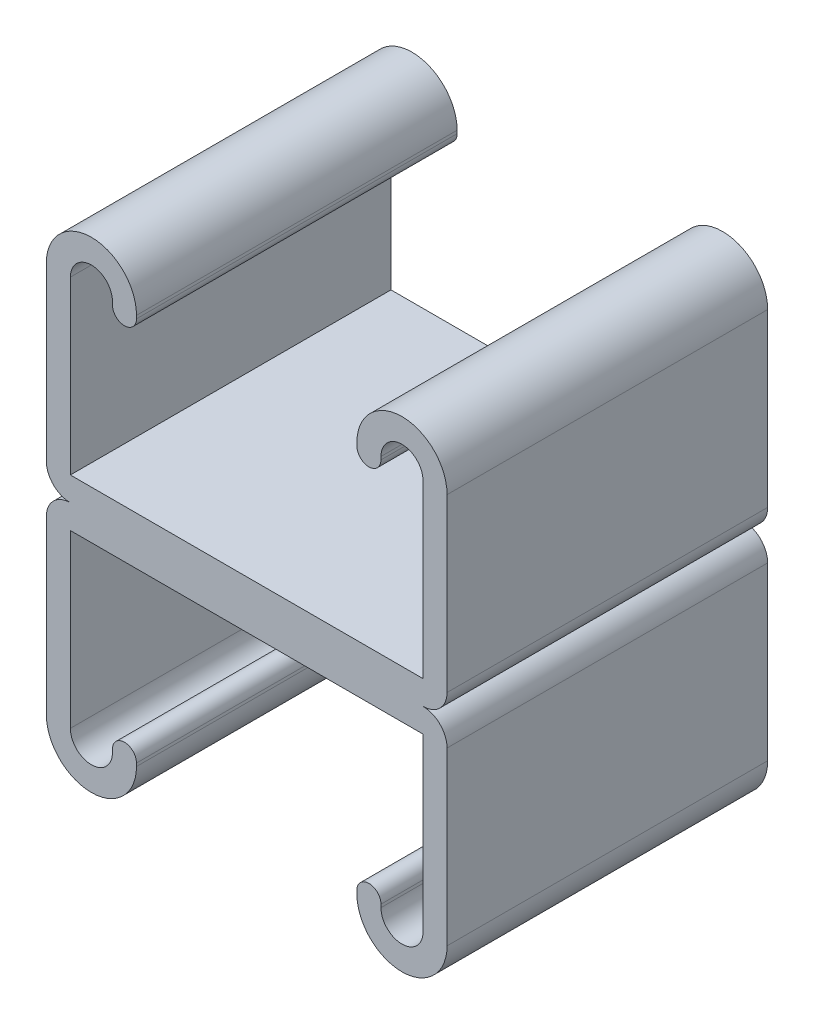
ISO-10303-21;
HEADER;
FILE_DESCRIPTION(('STEP AP214'),'2;1');
FILE_NAME('part.step','',(''),(''),'','','');
FILE_SCHEMA(('AUTOMOTIVE_DESIGN { 1 0 10303 214 1 1 1 1 }'));
ENDSEC;
DATA;
#1=APPLICATION_CONTEXT('core data for automotive mechanical design processes');
#2=APPLICATION_PROTOCOL_DEFINITION('international standard','automotive_design',2000,#1);
#3=PRODUCT_CONTEXT('',#1,'mechanical');
#4=PRODUCT('Part','Part','',(#3));
#5=PRODUCT_RELATED_PRODUCT_CATEGORY('part','',(#4));
#6=PRODUCT_DEFINITION_FORMATION('','',#4);
#7=PRODUCT_DEFINITION_CONTEXT('part definition',#1,'design');
#8=PRODUCT_DEFINITION('design','',#6,#7);
#9=PRODUCT_DEFINITION_SHAPE('','',#8);
#10=(LENGTH_UNIT() NAMED_UNIT(*) SI_UNIT(.MILLI.,.METRE.));
#11=(NAMED_UNIT(*) PLANE_ANGLE_UNIT() SI_UNIT($,.RADIAN.));
#12=(NAMED_UNIT(*) SI_UNIT($,.STERADIAN.) SOLID_ANGLE_UNIT());
#13=UNCERTAINTY_MEASURE_WITH_UNIT(LENGTH_MEASURE(1.E-05),#10,'distance_accuracy_value','');
#14=(GEOMETRIC_REPRESENTATION_CONTEXT(3) GLOBAL_UNCERTAINTY_ASSIGNED_CONTEXT((#13)) GLOBAL_UNIT_ASSIGNED_CONTEXT((#10,
#11,#12)) REPRESENTATION_CONTEXT('',''));
#15=CARTESIAN_POINT('',(0.,0.,0.));
#16=DIRECTION('',(0.,0.,1.));
#17=DIRECTION('',(1.,0.,0.));
#18=AXIS2_PLACEMENT_3D('',#15,#16,#17);
#19=CARTESIAN_POINT('',(-12.303125,15.478125,12.7));
#20=DIRECTION('',(0.,0.,-1.));
#21=DIRECTION('',(-1.,0.,0.));
#22=AXIS2_PLACEMENT_3D('',#19,#20,#21);
#23=CYLINDRICAL_SURFACE('',#22,3.571875);
#24=CARTESIAN_POINT('',(-12.303125,15.478125,-12.7));
#25=DIRECTION('',(0.,0.,1.));
#26=DIRECTION('',(-1.,0.,0.));
#27=AXIS2_PLACEMENT_3D('',#24,#25,#26);
#28=CIRCLE('',#27,3.571875);
#29=CARTESIAN_POINT('',(-8.73125000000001,15.478125,-12.7));
#30=VERTEX_POINT('',#29);
#31=CARTESIAN_POINT('',(-15.875,15.478125,-12.7));
#32=VERTEX_POINT('',#31);
#33=EDGE_CURVE('E190',#30,#32,#28,.T.);
#34=ORIENTED_EDGE('',*,*,#33,.T.);
#35=DIRECTION('',(0.,0.,-1.));
#36=VECTOR('',#35,1.);
#37=CARTESIAN_POINT('',(-15.875,15.478125,12.7));
#38=LINE('',#37,#36);
#39=CARTESIAN_POINT('',(-15.875,15.478125,12.7));
#40=VERTEX_POINT('',#39);
#41=EDGE_CURVE('E11',#40,#32,#38,.T.);
#42=ORIENTED_EDGE('',*,*,#41,.F.);
#43=CARTESIAN_POINT('',(-12.303125,15.478125,12.7));
#44=DIRECTION('',(0.,0.,1.));
#45=DIRECTION('',(-1.,0.,0.));
#46=AXIS2_PLACEMENT_3D('',#43,#44,#45);
#47=CIRCLE('',#46,3.571875);
#48=CARTESIAN_POINT('',(-8.73125000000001,15.478125,12.7));
#49=VERTEX_POINT('',#48);
#50=EDGE_CURVE('E223',#49,#40,#47,.T.);
#51=ORIENTED_EDGE('',*,*,#50,.F.);
#52=DIRECTION('',(0.,0.,-1.));
#53=VECTOR('',#52,1.);
#54=CARTESIAN_POINT('',(-8.73125000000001,15.478125,12.7));
#55=LINE('',#54,#53);
#56=EDGE_CURVE('E186',#49,#30,#55,.T.);
#57=ORIENTED_EDGE('',*,*,#56,.T.);
#58=EDGE_LOOP('',(#34,#42,#51,#57));
#59=FACE_BOUND('',#58,.T.);
#60=ADVANCED_FACE('F33',(#59),#23,.T.);
#61=CARTESIAN_POINT('',(-15.875,15.478125,12.7));
#62=DIRECTION('',(1.,0.,0.));
#63=DIRECTION('',(0.,1.,0.));
#64=AXIS2_PLACEMENT_3D('',#61,#62,#63);
#65=PLANE('',#64);
#66=DIRECTION('',(0.,-1.,0.));
#67=VECTOR('',#66,1.);
#68=CARTESIAN_POINT('',(-15.875,15.478125,-12.7));
#69=LINE('',#68,#67);
#70=CARTESIAN_POINT('',(-15.875,1.905,-12.7));
#71=VERTEX_POINT('',#70);
#72=EDGE_CURVE('E193',#32,#71,#69,.T.);
#73=ORIENTED_EDGE('',*,*,#72,.T.);
#74=DIRECTION('',(0.,0.,-1.));
#75=VECTOR('',#74,1.);
#76=CARTESIAN_POINT('',(-15.875,1.905,12.7));
#77=LINE('',#76,#75);
#78=CARTESIAN_POINT('',(-15.875,1.905,12.7));
#79=VERTEX_POINT('',#78);
#80=EDGE_CURVE('E41',#79,#71,#77,.T.);
#81=ORIENTED_EDGE('',*,*,#80,.F.);
#82=DIRECTION('',(0.,-1.,0.));
#83=VECTOR('',#82,1.);
#84=CARTESIAN_POINT('',(-15.875,15.478125,12.7));
#85=LINE('',#84,#83);
#86=EDGE_CURVE('E120',#40,#79,#85,.T.);
#87=ORIENTED_EDGE('',*,*,#86,.F.);
#88=ORIENTED_EDGE('',*,*,#41,.T.);
#89=EDGE_LOOP('',(#73,#81,#87,#88));
#90=FACE_BOUND('',#89,.T.);
#91=ADVANCED_FACE('F385',(#90),#65,.F.);
#92=CARTESIAN_POINT('',(-13.97,1.905,12.7));
#93=DIRECTION('',(0.,0.,-1.));
#94=DIRECTION('',(-1.,0.,0.));
#95=AXIS2_PLACEMENT_3D('',#92,#93,#94);
#96=CYLINDRICAL_SURFACE('',#95,1.905);
#97=CARTESIAN_POINT('',(-13.97,1.905,-12.7));
#98=DIRECTION('',(0.,0.,1.));
#99=DIRECTION('',(-1.,0.,0.));
#100=AXIS2_PLACEMENT_3D('',#97,#98,#99);
#101=CIRCLE('',#100,1.905);
#102=CARTESIAN_POINT('',(-13.97,0.,-12.7));
#103=VERTEX_POINT('',#102);
#104=EDGE_CURVE('E196',#71,#103,#101,.T.);
#105=ORIENTED_EDGE('',*,*,#104,.T.);
#106=DIRECTION('',(0.,0.,-1.));
#107=VECTOR('',#106,1.);
#108=CARTESIAN_POINT('',(-13.97,0.,12.7));
#109=LINE('',#108,#107);
#110=CARTESIAN_POINT('',(-13.97,0.,12.7));
#111=VERTEX_POINT('',#110);
#112=EDGE_CURVE('E260',#111,#103,#109,.T.);
#113=ORIENTED_EDGE('',*,*,#112,.F.);
#114=CARTESIAN_POINT('',(-13.97,1.905,12.7));
#115=DIRECTION('',(0.,0.,1.));
#116=DIRECTION('',(-1.,0.,0.));
#117=AXIS2_PLACEMENT_3D('',#114,#115,#116);
#118=CIRCLE('',#117,1.905);
#119=EDGE_CURVE('E268',#79,#111,#118,.T.);
#120=ORIENTED_EDGE('',*,*,#119,.F.);
#121=ORIENTED_EDGE('',*,*,#80,.T.);
#122=EDGE_LOOP('',(#105,#113,#120,#121));
#123=FACE_BOUND('',#122,.T.);
#124=ADVANCED_FACE('F266',(#123),#96,.T.);
#125=CARTESIAN_POINT('',(13.97,1.90500000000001,12.7));
#126=DIRECTION('',(0.,0.,-1.));
#127=DIRECTION('',(-1.,0.,0.));
#128=AXIS2_PLACEMENT_3D('',#125,#126,#127);
#129=CYLINDRICAL_SURFACE('',#128,1.905);
#130=CARTESIAN_POINT('',(13.97,1.90500000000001,-12.7));
#131=DIRECTION('',(0.,0.,1.));
#132=DIRECTION('',(1.,0.,0.));
#133=AXIS2_PLACEMENT_3D('',#130,#131,#132);
#134=CIRCLE('',#133,1.905);
#135=CARTESIAN_POINT('',(13.97,0.,-12.7));
#136=VERTEX_POINT('',#135);
#137=CARTESIAN_POINT('',(15.875,1.90500000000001,-12.7));
#138=VERTEX_POINT('',#137);
#139=EDGE_CURVE('E198',#136,#138,#134,.T.);
#140=ORIENTED_EDGE('',*,*,#139,.T.);
#141=DIRECTION('',(0.,0.,-1.));
#142=VECTOR('',#141,1.);
#143=CARTESIAN_POINT('',(15.875,1.90500000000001,12.7));
#144=LINE('',#143,#142);
#145=CARTESIAN_POINT('',(15.875,1.90500000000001,12.7));
#146=VERTEX_POINT('',#145);
#147=EDGE_CURVE('E254',#146,#138,#144,.T.);
#148=ORIENTED_EDGE('',*,*,#147,.F.);
#149=CARTESIAN_POINT('',(13.97,1.90500000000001,12.7));
#150=DIRECTION('',(0.,0.,1.));
#151=DIRECTION('',(1.,0.,0.));
#152=AXIS2_PLACEMENT_3D('',#149,#150,#151);
#153=CIRCLE('',#152,1.905);
#154=CARTESIAN_POINT('',(13.97,0.,12.7));
#155=VERTEX_POINT('',#154);
#156=EDGE_CURVE('E342',#155,#146,#153,.T.);
#157=ORIENTED_EDGE('',*,*,#156,.F.);
#158=DIRECTION('',(0.,0.,-1.));
#159=VECTOR('',#158,1.);
#160=CARTESIAN_POINT('',(13.97,0.,12.7));
#161=LINE('',#160,#159);
#162=EDGE_CURVE('E257',#155,#136,#161,.T.);
#163=ORIENTED_EDGE('',*,*,#162,.T.);
#164=EDGE_LOOP('',(#140,#148,#157,#163));
#165=FACE_BOUND('',#164,.T.);
#166=ADVANCED_FACE('F392',(#165),#129,.T.);
#167=CARTESIAN_POINT('',(15.875,1.90500000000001,12.7));
#168=DIRECTION('',(-1.,0.,0.));
#169=DIRECTION('',(0.,0.,1.));
#170=AXIS2_PLACEMENT_3D('',#167,#168,#169);
#171=PLANE('',#170);
#172=DIRECTION('',(0.,1.,0.));
#173=VECTOR('',#172,1.);
#174=CARTESIAN_POINT('',(15.875,1.90500000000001,-12.7));
#175=LINE('',#174,#173);
#176=CARTESIAN_POINT('',(15.875,15.478125,-12.7));
#177=VERTEX_POINT('',#176);
#178=EDGE_CURVE('E200',#138,#177,#175,.T.);
#179=ORIENTED_EDGE('',*,*,#178,.T.);
#180=DIRECTION('',(0.,0.,-1.));
#181=VECTOR('',#180,1.);
#182=CARTESIAN_POINT('',(15.875,15.478125,12.7));
#183=LINE('',#182,#181);
#184=CARTESIAN_POINT('',(15.875,15.478125,12.7));
#185=VERTEX_POINT('',#184);
#186=EDGE_CURVE('E251',#185,#177,#183,.T.);
#187=ORIENTED_EDGE('',*,*,#186,.F.);
#188=DIRECTION('',(0.,1.,0.));
#189=VECTOR('',#188,1.);
#190=CARTESIAN_POINT('',(15.875,1.90500000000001,12.7));
#191=LINE('',#190,#189);
#192=EDGE_CURVE('E344',#146,#185,#191,.T.);
#193=ORIENTED_EDGE('',*,*,#192,.F.);
#194=ORIENTED_EDGE('',*,*,#147,.T.);
#195=EDGE_LOOP('',(#179,#187,#193,#194));
#196=FACE_BOUND('',#195,.T.);
#197=ADVANCED_FACE('F397',(#196),#171,.F.);
#198=CARTESIAN_POINT('',(12.303125,15.478125,12.7));
#199=DIRECTION('',(0.,0.,-1.));
#200=DIRECTION('',(-1.,0.,0.));
#201=AXIS2_PLACEMENT_3D('',#198,#199,#200);
#202=CYLINDRICAL_SURFACE('',#201,3.571875);
#203=CARTESIAN_POINT('',(12.303125,15.478125,-12.7));
#204=DIRECTION('',(0.,0.,1.));
#205=DIRECTION('',(1.,0.,0.));
#206=AXIS2_PLACEMENT_3D('',#203,#204,#205);
#207=CIRCLE('',#206,3.571875);
#208=CARTESIAN_POINT('',(8.73124999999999,15.478125,-12.7));
#209=VERTEX_POINT('',#208);
#210=EDGE_CURVE('E202',#177,#209,#207,.T.);
#211=ORIENTED_EDGE('',*,*,#210,.T.);
#212=DIRECTION('',(0.,0.,-1.));
#213=VECTOR('',#212,1.);
#214=CARTESIAN_POINT('',(8.73124999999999,15.478125,12.7));
#215=LINE('',#214,#213);
#216=CARTESIAN_POINT('',(8.73124999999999,15.478125,12.7));
#217=VERTEX_POINT('',#216);
#218=EDGE_CURVE('E248',#217,#209,#215,.T.);
#219=ORIENTED_EDGE('',*,*,#218,.F.);
#220=CARTESIAN_POINT('',(12.303125,15.478125,12.7));
#221=DIRECTION('',(0.,0.,1.));
#222=DIRECTION('',(1.,0.,0.));
#223=AXIS2_PLACEMENT_3D('',#220,#221,#222);
#224=CIRCLE('',#223,3.571875);
#225=EDGE_CURVE('E346',#185,#217,#224,.T.);
#226=ORIENTED_EDGE('',*,*,#225,.F.);
#227=ORIENTED_EDGE('',*,*,#186,.T.);
#228=EDGE_LOOP('',(#211,#219,#226,#227));
#229=FACE_BOUND('',#228,.T.);
#230=ADVANCED_FACE('F401',(#229),#202,.T.);
#231=CARTESIAN_POINT('',(8.73124999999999,15.478125,12.7));
#232=DIRECTION('',(1.,0.,0.));
#233=DIRECTION('',(0.,1.,0.));
#234=AXIS2_PLACEMENT_3D('',#231,#232,#233);
#235=PLANE('',#234);
#236=DIRECTION('',(0.,-1.,0.));
#237=VECTOR('',#236,1.);
#238=CARTESIAN_POINT('',(8.73124999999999,15.478125,-12.7));
#239=LINE('',#238,#237);
#240=CARTESIAN_POINT('',(8.73125,15.24,-12.7));
#241=VERTEX_POINT('',#240);
#242=EDGE_CURVE('E204',#209,#241,#239,.T.);
#243=ORIENTED_EDGE('',*,*,#242,.T.);
#244=DIRECTION('',(0.,0.,-1.));
#245=VECTOR('',#244,1.);
#246=CARTESIAN_POINT('',(8.73125,15.24,12.7));
#247=LINE('',#246,#245);
#248=CARTESIAN_POINT('',(8.73125,15.24,12.7));
#249=VERTEX_POINT('',#248);
#250=EDGE_CURVE('E245',#249,#241,#247,.T.);
#251=ORIENTED_EDGE('',*,*,#250,.F.);
#252=DIRECTION('',(0.,-1.,0.));
#253=VECTOR('',#252,1.);
#254=CARTESIAN_POINT('',(8.73124999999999,15.478125,12.7));
#255=LINE('',#254,#253);
#256=EDGE_CURVE('E348',#217,#249,#255,.T.);
#257=ORIENTED_EDGE('',*,*,#256,.F.);
#258=ORIENTED_EDGE('',*,*,#218,.T.);
#259=EDGE_LOOP('',(#243,#251,#257,#258));
#260=FACE_BOUND('',#259,.T.);
#261=ADVANCED_FACE('F405',(#260),#235,.F.);
#262=CARTESIAN_POINT('',(9.68375,15.24,12.7));
#263=DIRECTION('',(0.,0.,-1.));
#264=DIRECTION('',(-1.,0.,0.));
#265=AXIS2_PLACEMENT_3D('',#262,#263,#264);
#266=CYLINDRICAL_SURFACE('',#265,0.9525);
#267=CARTESIAN_POINT('',(9.68375,15.24,-12.7));
#268=DIRECTION('',(0.,0.,1.));
#269=DIRECTION('',(1.,0.,0.));
#270=AXIS2_PLACEMENT_3D('',#267,#268,#269);
#271=CIRCLE('',#270,0.9525);
#272=CARTESIAN_POINT('',(10.63625,15.24,-12.7));
#273=VERTEX_POINT('',#272);
#274=EDGE_CURVE('E206',#241,#273,#271,.T.);
#275=ORIENTED_EDGE('',*,*,#274,.T.);
#276=DIRECTION('',(0.,0.,-1.));
#277=VECTOR('',#276,1.);
#278=CARTESIAN_POINT('',(10.63625,15.24,12.7));
#279=LINE('',#278,#277);
#280=CARTESIAN_POINT('',(10.63625,15.24,12.7));
#281=VERTEX_POINT('',#280);
#282=EDGE_CURVE('E242',#281,#273,#279,.T.);
#283=ORIENTED_EDGE('',*,*,#282,.F.);
#284=CARTESIAN_POINT('',(9.68375,15.24,12.7));
#285=DIRECTION('',(0.,0.,1.));
#286=DIRECTION('',(1.,0.,0.));
#287=AXIS2_PLACEMENT_3D('',#284,#285,#286);
#288=CIRCLE('',#287,0.9525);
#289=EDGE_CURVE('E350',#249,#281,#288,.T.);
#290=ORIENTED_EDGE('',*,*,#289,.F.);
#291=ORIENTED_EDGE('',*,*,#250,.T.);
#292=EDGE_LOOP('',(#275,#283,#290,#291));
#293=FACE_BOUND('',#292,.T.);
#294=ADVANCED_FACE('F409',(#293),#266,.T.);
#295=CARTESIAN_POINT('',(10.63625,15.478125,12.7));
#296=DIRECTION('',(-1.,0.,0.));
#297=DIRECTION('',(0.,-1.,0.));
#298=AXIS2_PLACEMENT_3D('',#295,#296,#297);
#299=PLANE('',#298);
#300=DIRECTION('',(0.,1.,0.));
#301=VECTOR('',#300,1.);
#302=CARTESIAN_POINT('',(10.63625,15.478125,-12.7));
#303=LINE('',#302,#301);
#304=CARTESIAN_POINT('',(10.63625,15.478125,-12.7));
#305=VERTEX_POINT('',#304);
#306=EDGE_CURVE('E208',#273,#305,#303,.T.);
#307=ORIENTED_EDGE('',*,*,#306,.T.);
#308=DIRECTION('',(0.,0.,-1.));
#309=VECTOR('',#308,1.);
#310=CARTESIAN_POINT('',(10.63625,15.478125,12.7));
#311=LINE('',#310,#309);
#312=CARTESIAN_POINT('',(10.63625,15.478125,12.7));
#313=VERTEX_POINT('',#312);
#314=EDGE_CURVE('E239',#313,#305,#311,.T.);
#315=ORIENTED_EDGE('',*,*,#314,.F.);
#316=DIRECTION('',(0.,1.,0.));
#317=VECTOR('',#316,1.);
#318=CARTESIAN_POINT('',(10.63625,15.478125,12.7));
#319=LINE('',#318,#317);
#320=EDGE_CURVE('E352',#281,#313,#319,.T.);
#321=ORIENTED_EDGE('',*,*,#320,.F.);
#322=ORIENTED_EDGE('',*,*,#282,.T.);
#323=EDGE_LOOP('',(#307,#315,#321,#322));
#324=FACE_BOUND('',#323,.T.);
#325=ADVANCED_FACE('F413',(#324),#299,.F.);
#326=CARTESIAN_POINT('',(12.303125,15.478125,12.7));
#327=DIRECTION('',(0.,0.,-1.));
#328=DIRECTION('',(-1.,0.,0.));
#329=AXIS2_PLACEMENT_3D('',#326,#327,#328);
#330=CYLINDRICAL_SURFACE('',#329,1.666875);
#331=CARTESIAN_POINT('',(12.303125,15.478125,-12.7));
#332=DIRECTION('',(0.,0.,-1.));
#333=DIRECTION('',(1.,0.,0.));
#334=AXIS2_PLACEMENT_3D('',#331,#332,#333);
#335=CIRCLE('',#334,1.666875);
#336=CARTESIAN_POINT('',(13.97,15.478125,-12.7));
#337=VERTEX_POINT('',#336);
#338=EDGE_CURVE('E210',#305,#337,#335,.T.);
#339=ORIENTED_EDGE('',*,*,#338,.T.);
#340=DIRECTION('',(0.,0.,-1.));
#341=VECTOR('',#340,1.);
#342=CARTESIAN_POINT('',(13.97,15.478125,12.7));
#343=LINE('',#342,#341);
#344=CARTESIAN_POINT('',(13.97,15.478125,12.7));
#345=VERTEX_POINT('',#344);
#346=EDGE_CURVE('E236',#345,#337,#343,.T.);
#347=ORIENTED_EDGE('',*,*,#346,.F.);
#348=CARTESIAN_POINT('',(12.303125,15.478125,12.7));
#349=DIRECTION('',(0.,0.,-1.));
#350=DIRECTION('',(1.,0.,0.));
#351=AXIS2_PLACEMENT_3D('',#348,#349,#350);
#352=CIRCLE('',#351,1.666875);
#353=EDGE_CURVE('E354',#313,#345,#352,.T.);
#354=ORIENTED_EDGE('',*,*,#353,.F.);
#355=ORIENTED_EDGE('',*,*,#314,.T.);
#356=EDGE_LOOP('',(#339,#347,#354,#355));
#357=FACE_BOUND('',#356,.T.);
#358=ADVANCED_FACE('F417',(#357),#330,.F.);
#359=CARTESIAN_POINT('',(13.97,1.905,12.7));
#360=DIRECTION('',(1.,0.,0.));
#361=DIRECTION('',(0.,0.,-1.));
#362=AXIS2_PLACEMENT_3D('',#359,#360,#361);
#363=PLANE('',#362);
#364=DIRECTION('',(0.,-1.,0.));
#365=VECTOR('',#364,1.);
#366=CARTESIAN_POINT('',(13.97,1.905,-12.7));
#367=LINE('',#366,#365);
#368=CARTESIAN_POINT('',(13.97,1.905,-12.7));
#369=VERTEX_POINT('',#368);
#370=EDGE_CURVE('E212',#337,#369,#367,.T.);
#371=ORIENTED_EDGE('',*,*,#370,.T.);
#372=DIRECTION('',(0.,0.,-1.));
#373=VECTOR('',#372,1.);
#374=CARTESIAN_POINT('',(13.97,1.905,12.7));
#375=LINE('',#374,#373);
#376=CARTESIAN_POINT('',(13.97,1.905,12.7));
#377=VERTEX_POINT('',#376);
#378=EDGE_CURVE('E233',#377,#369,#375,.T.);
#379=ORIENTED_EDGE('',*,*,#378,.F.);
#380=DIRECTION('',(0.,-1.,0.));
#381=VECTOR('',#380,1.);
#382=CARTESIAN_POINT('',(13.97,1.905,12.7));
#383=LINE('',#382,#381);
#384=EDGE_CURVE('E356',#345,#377,#383,.T.);
#385=ORIENTED_EDGE('',*,*,#384,.F.);
#386=ORIENTED_EDGE('',*,*,#346,.T.);
#387=EDGE_LOOP('',(#371,#379,#385,#386));
#388=FACE_BOUND('',#387,.T.);
#389=ADVANCED_FACE('F421',(#388),#363,.F.);
#390=CARTESIAN_POINT('',(-13.97,1.905,12.7));
#391=DIRECTION('',(0.,-1.,0.));
#392=DIRECTION('',(1.,0.,0.));
#393=AXIS2_PLACEMENT_3D('',#390,#391,#392);
#394=PLANE('',#393);
#395=DIRECTION('',(-1.,0.,0.));
#396=VECTOR('',#395,1.);
#397=CARTESIAN_POINT('',(-13.97,1.905,-12.7));
#398=LINE('',#397,#396);
#399=CARTESIAN_POINT('',(-13.97,1.905,-12.7));
#400=VERTEX_POINT('',#399);
#401=EDGE_CURVE('E214',#369,#400,#398,.T.);
#402=ORIENTED_EDGE('',*,*,#401,.T.);
#403=DIRECTION('',(0.,0.,-1.));
#404=VECTOR('',#403,1.);
#405=CARTESIAN_POINT('',(-13.97,1.905,12.7));
#406=LINE('',#405,#404);
#407=CARTESIAN_POINT('',(-13.97,1.905,12.7));
#408=VERTEX_POINT('',#407);
#409=EDGE_CURVE('E230',#408,#400,#406,.T.);
#410=ORIENTED_EDGE('',*,*,#409,.F.);
#411=DIRECTION('',(-1.,0.,0.));
#412=VECTOR('',#411,1.);
#413=CARTESIAN_POINT('',(-13.97,1.905,12.7));
#414=LINE('',#413,#412);
#415=EDGE_CURVE('E358',#377,#408,#414,.T.);
#416=ORIENTED_EDGE('',*,*,#415,.F.);
#417=ORIENTED_EDGE('',*,*,#378,.T.);
#418=EDGE_LOOP('',(#402,#410,#416,#417));
#419=FACE_BOUND('',#418,.T.);
#420=ADVANCED_FACE('F425',(#419),#394,.F.);
#421=CARTESIAN_POINT('',(-13.97,15.478125,12.7));
#422=DIRECTION('',(-1.,0.,0.));
#423=DIRECTION('',(0.,-1.,0.));
#424=AXIS2_PLACEMENT_3D('',#421,#422,#423);
#425=PLANE('',#424);
#426=DIRECTION('',(0.,1.,0.));
#427=VECTOR('',#426,1.);
#428=CARTESIAN_POINT('',(-13.97,15.478125,-12.7));
#429=LINE('',#428,#427);
#430=CARTESIAN_POINT('',(-13.97,15.478125,-12.7));
#431=VERTEX_POINT('',#430);
#432=EDGE_CURVE('E216',#400,#431,#429,.T.);
#433=ORIENTED_EDGE('',*,*,#432,.T.);
#434=DIRECTION('',(0.,0.,-1.));
#435=VECTOR('',#434,1.);
#436=CARTESIAN_POINT('',(-13.97,15.478125,12.7));
#437=LINE('',#436,#435);
#438=CARTESIAN_POINT('',(-13.97,15.478125,12.7));
#439=VERTEX_POINT('',#438);
#440=EDGE_CURVE('E227',#439,#431,#437,.T.);
#441=ORIENTED_EDGE('',*,*,#440,.F.);
#442=DIRECTION('',(0.,1.,0.));
#443=VECTOR('',#442,1.);
#444=CARTESIAN_POINT('',(-13.97,15.478125,12.7));
#445=LINE('',#444,#443);
#446=EDGE_CURVE('E360',#408,#439,#445,.T.);
#447=ORIENTED_EDGE('',*,*,#446,.F.);
#448=ORIENTED_EDGE('',*,*,#409,.T.);
#449=EDGE_LOOP('',(#433,#441,#447,#448));
#450=FACE_BOUND('',#449,.T.);
#451=ADVANCED_FACE('F366',(#450),#425,.F.);
#452=CARTESIAN_POINT('',(-12.303125,15.478125,12.7));
#453=DIRECTION('',(0.,0.,-1.));
#454=DIRECTION('',(-1.,0.,0.));
#455=AXIS2_PLACEMENT_3D('',#452,#453,#454);
#456=CYLINDRICAL_SURFACE('',#455,1.666875);
#457=CARTESIAN_POINT('',(-12.303125,15.478125,-12.7));
#458=DIRECTION('',(0.,0.,-1.));
#459=DIRECTION('',(-1.,0.,0.));
#460=AXIS2_PLACEMENT_3D('',#457,#458,#459);
#461=CIRCLE('',#460,1.666875);
#462=CARTESIAN_POINT('',(-10.63625,15.478125,-12.7));
#463=VERTEX_POINT('',#462);
#464=EDGE_CURVE('E218',#431,#463,#461,.T.);
#465=ORIENTED_EDGE('',*,*,#464,.T.);
#466=DIRECTION('',(0.,0.,-1.));
#467=VECTOR('',#466,1.);
#468=CARTESIAN_POINT('',(-10.63625,15.478125,12.7));
#469=LINE('',#468,#467);
#470=CARTESIAN_POINT('',(-10.63625,15.478125,12.7));
#471=VERTEX_POINT('',#470);
#472=EDGE_CURVE('E181',#471,#463,#469,.T.);
#473=ORIENTED_EDGE('',*,*,#472,.F.);
#474=CARTESIAN_POINT('',(-12.303125,15.478125,12.7));
#475=DIRECTION('',(0.,0.,-1.));
#476=DIRECTION('',(-1.,0.,0.));
#477=AXIS2_PLACEMENT_3D('',#474,#475,#476);
#478=CIRCLE('',#477,1.666875);
#479=EDGE_CURVE('E172',#439,#471,#478,.T.);
#480=ORIENTED_EDGE('',*,*,#479,.F.);
#481=ORIENTED_EDGE('',*,*,#440,.T.);
#482=EDGE_LOOP('',(#465,#473,#480,#481));
#483=FACE_BOUND('',#482,.T.);
#484=ADVANCED_FACE('F370',(#483),#456,.F.);
#485=CARTESIAN_POINT('',(-10.63625,15.478125,12.7));
#486=DIRECTION('',(1.,0.,0.));
#487=DIRECTION('',(0.,1.,0.));
#488=AXIS2_PLACEMENT_3D('',#485,#486,#487);
#489=PLANE('',#488);
#490=DIRECTION('',(0.,-1.,0.));
#491=VECTOR('',#490,1.);
#492=CARTESIAN_POINT('',(-10.63625,15.478125,-12.7));
#493=LINE('',#492,#491);
#494=CARTESIAN_POINT('',(-10.63625,15.24,-12.7));
#495=VERTEX_POINT('',#494);
#496=EDGE_CURVE('E180',#463,#495,#493,.T.);
#497=ORIENTED_EDGE('',*,*,#496,.T.);
#498=DIRECTION('',(0.,0.,-1.));
#499=VECTOR('',#498,1.);
#500=CARTESIAN_POINT('',(-10.63625,15.24,12.7));
#501=LINE('',#500,#499);
#502=CARTESIAN_POINT('',(-10.63625,15.24,12.7));
#503=VERTEX_POINT('',#502);
#504=EDGE_CURVE('E177',#503,#495,#501,.T.);
#505=ORIENTED_EDGE('',*,*,#504,.F.);
#506=DIRECTION('',(0.,-1.,0.));
#507=VECTOR('',#506,1.);
#508=CARTESIAN_POINT('',(-10.63625,15.478125,12.7));
#509=LINE('',#508,#507);
#510=EDGE_CURVE('E166',#471,#503,#509,.T.);
#511=ORIENTED_EDGE('',*,*,#510,.F.);
#512=ORIENTED_EDGE('',*,*,#472,.T.);
#513=EDGE_LOOP('',(#497,#505,#511,#512));
#514=FACE_BOUND('',#513,.T.);
#515=ADVANCED_FACE('F178',(#514),#489,.F.);
#516=CARTESIAN_POINT('',(-9.68375,15.24,12.7));
#517=DIRECTION('',(0.,0.,-1.));
#518=DIRECTION('',(-1.,0.,0.));
#519=AXIS2_PLACEMENT_3D('',#516,#517,#518);
#520=CYLINDRICAL_SURFACE('',#519,0.952499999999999);
#521=CARTESIAN_POINT('',(-9.68375,15.24,-12.7));
#522=DIRECTION('',(0.,0.,1.));
#523=DIRECTION('',(-1.,0.,0.));
#524=AXIS2_PLACEMENT_3D('',#521,#522,#523);
#525=CIRCLE('',#524,0.952499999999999);
#526=CARTESIAN_POINT('',(-8.73125,15.24,-12.7));
#527=VERTEX_POINT('',#526);
#528=EDGE_CURVE('E106',#495,#527,#525,.T.);
#529=ORIENTED_EDGE('',*,*,#528,.T.);
#530=DIRECTION('',(0.,0.,-1.));
#531=VECTOR('',#530,1.);
#532=CARTESIAN_POINT('',(-8.73125,15.24,12.7));
#533=LINE('',#532,#531);
#534=CARTESIAN_POINT('',(-8.73125,15.24,12.7));
#535=VERTEX_POINT('',#534);
#536=EDGE_CURVE('E182',#535,#527,#533,.T.);
#537=ORIENTED_EDGE('',*,*,#536,.F.);
#538=CARTESIAN_POINT('',(-9.68375,15.24,12.7));
#539=DIRECTION('',(0.,0.,1.));
#540=DIRECTION('',(-1.,0.,0.));
#541=AXIS2_PLACEMENT_3D('',#538,#539,#540);
#542=CIRCLE('',#541,0.952499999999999);
#543=EDGE_CURVE('E170',#503,#535,#542,.T.);
#544=ORIENTED_EDGE('',*,*,#543,.F.);
#545=ORIENTED_EDGE('',*,*,#504,.T.);
#546=EDGE_LOOP('',(#529,#537,#544,#545));
#547=FACE_BOUND('',#546,.T.);
#548=ADVANCED_FACE('F184',(#547),#520,.T.);
#549=CARTESIAN_POINT('',(-8.73125000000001,15.478125,12.7));
#550=DIRECTION('',(-1.,0.,0.));
#551=DIRECTION('',(0.,-1.,0.));
#552=AXIS2_PLACEMENT_3D('',#549,#550,#551);
#553=PLANE('',#552);
#554=DIRECTION('',(0.,1.,0.));
#555=VECTOR('',#554,1.);
#556=CARTESIAN_POINT('',(-8.73125000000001,15.478125,-12.7));
#557=LINE('',#556,#555);
#558=EDGE_CURVE('E112',#527,#30,#557,.T.);
#559=ORIENTED_EDGE('',*,*,#558,.T.);
#560=ORIENTED_EDGE('',*,*,#56,.F.);
#561=DIRECTION('',(0.,1.,0.));
#562=VECTOR('',#561,1.);
#563=CARTESIAN_POINT('',(-8.73125000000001,15.478125,12.7));
#564=LINE('',#563,#562);
#565=EDGE_CURVE('E49',#535,#49,#564,.T.);
#566=ORIENTED_EDGE('',*,*,#565,.F.);
#567=ORIENTED_EDGE('',*,*,#536,.T.);
#568=EDGE_LOOP('',(#559,#560,#566,#567));
#569=FACE_BOUND('',#568,.T.);
#570=ADVANCED_FACE('F374',(#569),#553,.F.);
#571=CARTESIAN_POINT('',(-12.303125,15.478125,12.7));
#572=DIRECTION('',(0.,0.,-1.));
#573=DIRECTION('',(-1.,0.,0.));
#574=AXIS2_PLACEMENT_3D('',#571,#572,#573);
#575=PLANE('',#574);
#576=ORIENTED_EDGE('',*,*,#50,.T.);
#577=ORIENTED_EDGE('',*,*,#86,.T.);
#578=ORIENTED_EDGE('',*,*,#119,.T.);
#579=CARTESIAN_POINT('',(-13.97,-1.905,12.7));
#580=DIRECTION('',(0.,0.,-1.));
#581=DIRECTION('',(-1.,0.,0.));
#582=AXIS2_PLACEMENT_3D('',#579,#580,#581);
#583=CIRCLE('',#582,1.905);
#584=CARTESIAN_POINT('',(-15.875,-1.905,12.7));
#585=VERTEX_POINT('',#584);
#586=EDGE_CURVE('E783',#585,#111,#583,.T.);
#587=ORIENTED_EDGE('',*,*,#586,.F.);
#588=DIRECTION('',(0.,1.,0.));
#589=VECTOR('',#588,1.);
#590=CARTESIAN_POINT('',(-15.875,-15.478125,12.7));
#591=LINE('',#590,#589);
#592=CARTESIAN_POINT('',(-15.875,-15.478125,12.7));
#593=VERTEX_POINT('',#592);
#594=EDGE_CURVE('E295',#593,#585,#591,.T.);
#595=ORIENTED_EDGE('',*,*,#594,.F.);
#596=CARTESIAN_POINT('',(-12.303125,-15.478125,12.7));
#597=DIRECTION('',(0.,0.,-1.));
#598=DIRECTION('',(-1.,0.,0.));
#599=AXIS2_PLACEMENT_3D('',#596,#597,#598);
#600=CIRCLE('',#599,3.571875);
#601=CARTESIAN_POINT('',(-8.73125000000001,-15.478125,12.7));
#602=VERTEX_POINT('',#601);
#603=EDGE_CURVE('E284',#602,#593,#600,.T.);
#604=ORIENTED_EDGE('',*,*,#603,.F.);
#605=DIRECTION('',(0.,-1.,0.));
#606=VECTOR('',#605,1.);
#607=CARTESIAN_POINT('',(-8.73125000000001,-15.478125,12.7));
#608=LINE('',#607,#606);
#609=CARTESIAN_POINT('',(-8.73125,-15.24,12.7));
#610=VERTEX_POINT('',#609);
#611=EDGE_CURVE('E732',#610,#602,#608,.T.);
#612=ORIENTED_EDGE('',*,*,#611,.F.);
#613=CARTESIAN_POINT('',(-9.68375,-15.24,12.7));
#614=DIRECTION('',(0.,0.,-1.));
#615=DIRECTION('',(-1.,0.,0.));
#616=AXIS2_PLACEMENT_3D('',#613,#614,#615);
#617=CIRCLE('',#616,0.952499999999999);
#618=CARTESIAN_POINT('',(-10.63625,-15.24,12.7));
#619=VERTEX_POINT('',#618);
#620=EDGE_CURVE('E741',#619,#610,#617,.T.);
#621=ORIENTED_EDGE('',*,*,#620,.F.);
#622=DIRECTION('',(0.,1.,0.));
#623=VECTOR('',#622,1.);
#624=CARTESIAN_POINT('',(-10.63625,-15.478125,12.7));
#625=LINE('',#624,#623);
#626=CARTESIAN_POINT('',(-10.63625,-15.478125,12.7));
#627=VERTEX_POINT('',#626);
#628=EDGE_CURVE('E745',#627,#619,#625,.T.);
#629=ORIENTED_EDGE('',*,*,#628,.F.);
#630=CARTESIAN_POINT('',(-12.303125,-15.478125,12.7));
#631=DIRECTION('',(0.,0.,1.));
#632=DIRECTION('',(-1.,0.,0.));
#633=AXIS2_PLACEMENT_3D('',#630,#631,#632);
#634=CIRCLE('',#633,1.666875);
#635=CARTESIAN_POINT('',(-13.97,-15.478125,12.7));
#636=VERTEX_POINT('',#635);
#637=EDGE_CURVE('E747',#636,#627,#634,.T.);
#638=ORIENTED_EDGE('',*,*,#637,.F.);
#639=DIRECTION('',(0.,-1.,0.));
#640=VECTOR('',#639,1.);
#641=CARTESIAN_POINT('',(-13.97,-15.478125,12.7));
#642=LINE('',#641,#640);
#643=CARTESIAN_POINT('',(-13.97,-1.905,12.7));
#644=VERTEX_POINT('',#643);
#645=EDGE_CURVE('E753',#644,#636,#642,.T.);
#646=ORIENTED_EDGE('',*,*,#645,.F.);
#647=DIRECTION('',(-1.,0.,0.));
#648=VECTOR('',#647,1.);
#649=CARTESIAN_POINT('',(-13.97,-1.905,12.7));
#650=LINE('',#649,#648);
#651=CARTESIAN_POINT('',(13.97,-1.905,12.7));
#652=VERTEX_POINT('',#651);
#653=EDGE_CURVE('E756',#652,#644,#650,.T.);
#654=ORIENTED_EDGE('',*,*,#653,.F.);
#655=DIRECTION('',(0.,1.,0.));
#656=VECTOR('',#655,1.);
#657=CARTESIAN_POINT('',(13.97,-1.905,12.7));
#658=LINE('',#657,#656);
#659=CARTESIAN_POINT('',(13.97,-15.478125,12.7));
#660=VERTEX_POINT('',#659);
#661=EDGE_CURVE('E759',#660,#652,#658,.T.);
#662=ORIENTED_EDGE('',*,*,#661,.F.);
#663=CARTESIAN_POINT('',(12.303125,-15.478125,12.7));
#664=DIRECTION('',(0.,0.,1.));
#665=DIRECTION('',(1.,0.,0.));
#666=AXIS2_PLACEMENT_3D('',#663,#664,#665);
#667=CIRCLE('',#666,1.666875);
#668=CARTESIAN_POINT('',(10.63625,-15.478125,12.7));
#669=VERTEX_POINT('',#668);
#670=EDGE_CURVE('E762',#669,#660,#667,.T.);
#671=ORIENTED_EDGE('',*,*,#670,.F.);
#672=DIRECTION('',(0.,-1.,0.));
#673=VECTOR('',#672,1.);
#674=CARTESIAN_POINT('',(10.63625,-15.478125,12.7));
#675=LINE('',#674,#673);
#676=CARTESIAN_POINT('',(10.63625,-15.24,12.7));
#677=VERTEX_POINT('',#676);
#678=EDGE_CURVE('E765',#677,#669,#675,.T.);
#679=ORIENTED_EDGE('',*,*,#678,.F.);
#680=CARTESIAN_POINT('',(9.68375,-15.24,12.7));
#681=DIRECTION('',(0.,0.,-1.));
#682=DIRECTION('',(1.,0.,0.));
#683=AXIS2_PLACEMENT_3D('',#680,#681,#682);
#684=CIRCLE('',#683,0.9525);
#685=CARTESIAN_POINT('',(8.73125,-15.24,12.7));
#686=VERTEX_POINT('',#685);
#687=EDGE_CURVE('E768',#686,#677,#684,.T.);
#688=ORIENTED_EDGE('',*,*,#687,.F.);
#689=DIRECTION('',(0.,1.,0.));
#690=VECTOR('',#689,1.);
#691=CARTESIAN_POINT('',(8.73124999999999,-15.478125,12.7));
#692=LINE('',#691,#690);
#693=CARTESIAN_POINT('',(8.73124999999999,-15.478125,12.7));
#694=VERTEX_POINT('',#693);
#695=EDGE_CURVE('E771',#694,#686,#692,.T.);
#696=ORIENTED_EDGE('',*,*,#695,.F.);
#697=CARTESIAN_POINT('',(12.303125,-15.478125,12.7));
#698=DIRECTION('',(0.,0.,-1.));
#699=DIRECTION('',(1.,0.,0.));
#700=AXIS2_PLACEMENT_3D('',#697,#698,#699);
#701=CIRCLE('',#700,3.571875);
#702=CARTESIAN_POINT('',(15.875,-15.478125,12.7));
#703=VERTEX_POINT('',#702);
#704=EDGE_CURVE('E774',#703,#694,#701,.T.);
#705=ORIENTED_EDGE('',*,*,#704,.F.);
#706=DIRECTION('',(0.,-1.,0.));
#707=VECTOR('',#706,1.);
#708=CARTESIAN_POINT('',(15.875,-1.90500000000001,12.7));
#709=LINE('',#708,#707);
#710=CARTESIAN_POINT('',(15.875,-1.90500000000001,12.7));
#711=VERTEX_POINT('',#710);
#712=EDGE_CURVE('E777',#711,#703,#709,.T.);
#713=ORIENTED_EDGE('',*,*,#712,.F.);
#714=CARTESIAN_POINT('',(13.97,-1.90500000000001,12.7));
#715=DIRECTION('',(0.,0.,-1.));
#716=DIRECTION('',(1.,0.,0.));
#717=AXIS2_PLACEMENT_3D('',#714,#715,#716);
#718=CIRCLE('',#717,1.905);
#719=EDGE_CURVE('E780',#155,#711,#718,.T.);
#720=ORIENTED_EDGE('',*,*,#719,.F.);
#721=ORIENTED_EDGE('',*,*,#156,.T.);
#722=ORIENTED_EDGE('',*,*,#192,.T.);
#723=ORIENTED_EDGE('',*,*,#225,.T.);
#724=ORIENTED_EDGE('',*,*,#256,.T.);
#725=ORIENTED_EDGE('',*,*,#289,.T.);
#726=ORIENTED_EDGE('',*,*,#320,.T.);
#727=ORIENTED_EDGE('',*,*,#353,.T.);
#728=ORIENTED_EDGE('',*,*,#384,.T.);
#729=ORIENTED_EDGE('',*,*,#415,.T.);
#730=ORIENTED_EDGE('',*,*,#446,.T.);
#731=ORIENTED_EDGE('',*,*,#479,.T.);
#732=ORIENTED_EDGE('',*,*,#510,.T.);
#733=ORIENTED_EDGE('',*,*,#543,.T.);
#734=ORIENTED_EDGE('',*,*,#565,.T.);
#735=EDGE_LOOP('',(#576,#577,#578,#587,#595,#604,#612,#621,#629,#638,#646,#654,#662,#671,#679,
#688,#696,#705,#713,#720,#721,#722,#723,#724,#725,#726,#727,#728,#729,#730,#731,#732,#733,#734));
#736=FACE_BOUND('',#735,.T.);
#737=ADVANCED_FACE('F168',(#736),#575,.F.);
#738=CARTESIAN_POINT('',(-12.303125,15.478125,-12.7));
#739=DIRECTION('',(0.,0.,-1.));
#740=DIRECTION('',(-1.,0.,0.));
#741=AXIS2_PLACEMENT_3D('',#738,#739,#740);
#742=PLANE('',#741);
#743=ORIENTED_EDGE('',*,*,#33,.F.);
#744=ORIENTED_EDGE('',*,*,#558,.F.);
#745=ORIENTED_EDGE('',*,*,#528,.F.);
#746=ORIENTED_EDGE('',*,*,#496,.F.);
#747=ORIENTED_EDGE('',*,*,#464,.F.);
#748=ORIENTED_EDGE('',*,*,#432,.F.);
#749=ORIENTED_EDGE('',*,*,#401,.F.);
#750=ORIENTED_EDGE('',*,*,#370,.F.);
#751=ORIENTED_EDGE('',*,*,#338,.F.);
#752=ORIENTED_EDGE('',*,*,#306,.F.);
#753=ORIENTED_EDGE('',*,*,#274,.F.);
#754=ORIENTED_EDGE('',*,*,#242,.F.);
#755=ORIENTED_EDGE('',*,*,#210,.F.);
#756=ORIENTED_EDGE('',*,*,#178,.F.);
#757=ORIENTED_EDGE('',*,*,#139,.F.);
#758=CARTESIAN_POINT('',(13.97,-1.90500000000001,-12.7));
#759=DIRECTION('',(0.,0.,-1.));
#760=DIRECTION('',(1.,0.,0.));
#761=AXIS2_PLACEMENT_3D('',#758,#759,#760);
#762=CIRCLE('',#761,1.905);
#763=CARTESIAN_POINT('',(15.875,-1.90500000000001,-12.7));
#764=VERTEX_POINT('',#763);
#765=EDGE_CURVE('E282',#136,#764,#762,.T.);
#766=ORIENTED_EDGE('',*,*,#765,.T.);
#767=DIRECTION('',(0.,-1.,0.));
#768=VECTOR('',#767,1.);
#769=CARTESIAN_POINT('',(15.875,-1.90500000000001,-12.7));
#770=LINE('',#769,#768);
#771=CARTESIAN_POINT('',(15.875,-15.478125,-12.7));
#772=VERTEX_POINT('',#771);
#773=EDGE_CURVE('E287',#764,#772,#770,.T.);
#774=ORIENTED_EDGE('',*,*,#773,.T.);
#775=CARTESIAN_POINT('',(12.303125,-15.478125,-12.7));
#776=DIRECTION('',(0.,0.,-1.));
#777=DIRECTION('',(1.,0.,0.));
#778=AXIS2_PLACEMENT_3D('',#775,#776,#777);
#779=CIRCLE('',#778,3.571875);
#780=CARTESIAN_POINT('',(8.73124999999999,-15.478125,-12.7));
#781=VERTEX_POINT('',#780);
#782=EDGE_CURVE('E819',#772,#781,#779,.T.);
#783=ORIENTED_EDGE('',*,*,#782,.T.);
#784=DIRECTION('',(0.,1.,0.));
#785=VECTOR('',#784,1.);
#786=CARTESIAN_POINT('',(8.73124999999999,-15.478125,-12.7));
#787=LINE('',#786,#785);
#788=CARTESIAN_POINT('',(8.73125,-15.24,-12.7));
#789=VERTEX_POINT('',#788);
#790=EDGE_CURVE('E816',#781,#789,#787,.T.);
#791=ORIENTED_EDGE('',*,*,#790,.T.);
#792=CARTESIAN_POINT('',(9.68375,-15.24,-12.7));
#793=DIRECTION('',(0.,0.,-1.));
#794=DIRECTION('',(1.,0.,0.));
#795=AXIS2_PLACEMENT_3D('',#792,#793,#794);
#796=CIRCLE('',#795,0.9525);
#797=CARTESIAN_POINT('',(10.63625,-15.24,-12.7));
#798=VERTEX_POINT('',#797);
#799=EDGE_CURVE('E813',#789,#798,#796,.T.);
#800=ORIENTED_EDGE('',*,*,#799,.T.);
#801=DIRECTION('',(0.,-1.,0.));
#802=VECTOR('',#801,1.);
#803=CARTESIAN_POINT('',(10.63625,-15.478125,-12.7));
#804=LINE('',#803,#802);
#805=CARTESIAN_POINT('',(10.63625,-15.478125,-12.7));
#806=VERTEX_POINT('',#805);
#807=EDGE_CURVE('E810',#798,#806,#804,.T.);
#808=ORIENTED_EDGE('',*,*,#807,.T.);
#809=CARTESIAN_POINT('',(12.303125,-15.478125,-12.7));
#810=DIRECTION('',(0.,0.,1.));
#811=DIRECTION('',(1.,0.,0.));
#812=AXIS2_PLACEMENT_3D('',#809,#810,#811);
#813=CIRCLE('',#812,1.666875);
#814=CARTESIAN_POINT('',(13.97,-15.478125,-12.7));
#815=VERTEX_POINT('',#814);
#816=EDGE_CURVE('E807',#806,#815,#813,.T.);
#817=ORIENTED_EDGE('',*,*,#816,.T.);
#818=DIRECTION('',(0.,1.,0.));
#819=VECTOR('',#818,1.);
#820=CARTESIAN_POINT('',(13.97,-1.905,-12.7));
#821=LINE('',#820,#819);
#822=CARTESIAN_POINT('',(13.97,-1.905,-12.7));
#823=VERTEX_POINT('',#822);
#824=EDGE_CURVE('E804',#815,#823,#821,.T.);
#825=ORIENTED_EDGE('',*,*,#824,.T.);
#826=DIRECTION('',(-1.,0.,0.));
#827=VECTOR('',#826,1.);
#828=CARTESIAN_POINT('',(-13.97,-1.905,-12.7));
#829=LINE('',#828,#827);
#830=CARTESIAN_POINT('',(-13.97,-1.905,-12.7));
#831=VERTEX_POINT('',#830);
#832=EDGE_CURVE('E801',#823,#831,#829,.T.);
#833=ORIENTED_EDGE('',*,*,#832,.T.);
#834=DIRECTION('',(0.,-1.,0.));
#835=VECTOR('',#834,1.);
#836=CARTESIAN_POINT('',(-13.97,-15.478125,-12.7));
#837=LINE('',#836,#835);
#838=CARTESIAN_POINT('',(-13.97,-15.478125,-12.7));
#839=VERTEX_POINT('',#838);
#840=EDGE_CURVE('E798',#831,#839,#837,.T.);
#841=ORIENTED_EDGE('',*,*,#840,.T.);
#842=CARTESIAN_POINT('',(-12.303125,-15.478125,-12.7));
#843=DIRECTION('',(0.,0.,1.));
#844=DIRECTION('',(-1.,0.,0.));
#845=AXIS2_PLACEMENT_3D('',#842,#843,#844);
#846=CIRCLE('',#845,1.666875);
#847=CARTESIAN_POINT('',(-10.63625,-15.478125,-12.7));
#848=VERTEX_POINT('',#847);
#849=EDGE_CURVE('E795',#839,#848,#846,.T.);
#850=ORIENTED_EDGE('',*,*,#849,.T.);
#851=DIRECTION('',(0.,1.,0.));
#852=VECTOR('',#851,1.);
#853=CARTESIAN_POINT('',(-10.63625,-15.478125,-12.7));
#854=LINE('',#853,#852);
#855=CARTESIAN_POINT('',(-10.63625,-15.24,-12.7));
#856=VERTEX_POINT('',#855);
#857=EDGE_CURVE('E792',#848,#856,#854,.T.);
#858=ORIENTED_EDGE('',*,*,#857,.T.);
#859=CARTESIAN_POINT('',(-9.68375,-15.24,-12.7));
#860=DIRECTION('',(0.,0.,-1.));
#861=DIRECTION('',(-1.,0.,0.));
#862=AXIS2_PLACEMENT_3D('',#859,#860,#861);
#863=CIRCLE('',#862,0.952499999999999);
#864=CARTESIAN_POINT('',(-8.73125,-15.24,-12.7));
#865=VERTEX_POINT('',#864);
#866=EDGE_CURVE('E790',#856,#865,#863,.T.);
#867=ORIENTED_EDGE('',*,*,#866,.T.);
#868=DIRECTION('',(0.,-1.,0.));
#869=VECTOR('',#868,1.);
#870=CARTESIAN_POINT('',(-8.73125000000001,-15.478125,-12.7));
#871=LINE('',#870,#869);
#872=CARTESIAN_POINT('',(-8.73125000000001,-15.478125,-12.7));
#873=VERTEX_POINT('',#872);
#874=EDGE_CURVE('E734',#865,#873,#871,.T.);
#875=ORIENTED_EDGE('',*,*,#874,.T.);
#876=CARTESIAN_POINT('',(-12.303125,-15.478125,-12.7));
#877=DIRECTION('',(0.,0.,-1.));
#878=DIRECTION('',(-1.,0.,0.));
#879=AXIS2_PLACEMENT_3D('',#876,#877,#878);
#880=CIRCLE('',#879,3.571875);
#881=CARTESIAN_POINT('',(-15.875,-15.478125,-12.7));
#882=VERTEX_POINT('',#881);
#883=EDGE_CURVE('E787',#873,#882,#880,.T.);
#884=ORIENTED_EDGE('',*,*,#883,.T.);
#885=DIRECTION('',(0.,1.,0.));
#886=VECTOR('',#885,1.);
#887=CARTESIAN_POINT('',(-15.875,-15.478125,-12.7));
#888=LINE('',#887,#886);
#889=CARTESIAN_POINT('',(-15.875,-1.905,-12.7));
#890=VERTEX_POINT('',#889);
#891=EDGE_CURVE('E279',#882,#890,#888,.T.);
#892=ORIENTED_EDGE('',*,*,#891,.T.);
#893=CARTESIAN_POINT('',(-13.97,-1.905,-12.7));
#894=DIRECTION('',(0.,0.,-1.));
#895=DIRECTION('',(-1.,0.,0.));
#896=AXIS2_PLACEMENT_3D('',#893,#894,#895);
#897=CIRCLE('',#896,1.905);
#898=EDGE_CURVE('E275',#890,#103,#897,.T.);
#899=ORIENTED_EDGE('',*,*,#898,.T.);
#900=ORIENTED_EDGE('',*,*,#104,.F.);
#901=ORIENTED_EDGE('',*,*,#72,.F.);
#902=EDGE_LOOP('',(#743,#744,#745,#746,#747,#748,#749,#750,#751,#752,#753,#754,#755,#756,#757,
#766,#774,#783,#791,#800,#808,#817,#825,#833,#841,#850,#858,#867,#875,#884,#892,#899,#900,#901));
#903=FACE_BOUND('',#902,.T.);
#904=ADVANCED_FACE('F272',(#903),#742,.T.);
#905=CARTESIAN_POINT('',(-12.303125,-15.478125,12.7));
#906=DIRECTION('',(0.,0.,-1.));
#907=DIRECTION('',(-1.,0.,0.));
#908=AXIS2_PLACEMENT_3D('',#905,#906,#907);
#909=CYLINDRICAL_SURFACE('',#908,3.571875);
#910=ORIENTED_EDGE('',*,*,#883,.F.);
#911=DIRECTION('',(0.,0.,-1.));
#912=VECTOR('',#911,1.);
#913=CARTESIAN_POINT('',(-8.73125000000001,-15.478125,12.7));
#914=LINE('',#913,#912);
#915=EDGE_CURVE('E194',#602,#873,#914,.T.);
#916=ORIENTED_EDGE('',*,*,#915,.F.);
#917=ORIENTED_EDGE('',*,*,#603,.T.);
#918=DIRECTION('',(0.,0.,-1.));
#919=VECTOR('',#918,1.);
#920=CARTESIAN_POINT('',(-15.875,-15.478125,12.7));
#921=LINE('',#920,#919);
#922=EDGE_CURVE('E291',#593,#882,#921,.T.);
#923=ORIENTED_EDGE('',*,*,#922,.T.);
#924=EDGE_LOOP('',(#910,#916,#917,#923));
#925=FACE_BOUND('',#924,.T.);
#926=ADVANCED_FACE('F478',(#925),#909,.T.);
#927=CARTESIAN_POINT('',(-8.73125000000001,-15.478125,12.7));
#928=DIRECTION('',(1.,0.,0.));
#929=DIRECTION('',(0.,1.,0.));
#930=AXIS2_PLACEMENT_3D('',#927,#928,#929);
#931=PLANE('',#930);
#932=ORIENTED_EDGE('',*,*,#874,.F.);
#933=DIRECTION('',(0.,0.,-1.));
#934=VECTOR('',#933,1.);
#935=CARTESIAN_POINT('',(-8.73125,-15.24,12.7));
#936=LINE('',#935,#934);
#937=EDGE_CURVE('E334',#610,#865,#936,.T.);
#938=ORIENTED_EDGE('',*,*,#937,.F.);
#939=ORIENTED_EDGE('',*,*,#611,.T.);
#940=ORIENTED_EDGE('',*,*,#915,.T.);
#941=EDGE_LOOP('',(#932,#938,#939,#940));
#942=FACE_BOUND('',#941,.T.);
#943=ADVANCED_FACE('F486',(#942),#931,.T.);
#944=CARTESIAN_POINT('',(-9.68375,-15.24,12.7));
#945=DIRECTION('',(0.,0.,-1.));
#946=DIRECTION('',(-1.,0.,0.));
#947=AXIS2_PLACEMENT_3D('',#944,#945,#946);
#948=CYLINDRICAL_SURFACE('',#947,0.952499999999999);
#949=ORIENTED_EDGE('',*,*,#866,.F.);
#950=DIRECTION('',(0.,0.,-1.));
#951=VECTOR('',#950,1.);
#952=CARTESIAN_POINT('',(-10.63625,-15.24,12.7));
#953=LINE('',#952,#951);
#954=EDGE_CURVE('E331',#619,#856,#953,.T.);
#955=ORIENTED_EDGE('',*,*,#954,.F.);
#956=ORIENTED_EDGE('',*,*,#620,.T.);
#957=ORIENTED_EDGE('',*,*,#937,.T.);
#958=EDGE_LOOP('',(#949,#955,#956,#957));
#959=FACE_BOUND('',#958,.T.);
#960=ADVANCED_FACE('F496',(#959),#948,.T.);
#961=CARTESIAN_POINT('',(-10.63625,-15.478125,12.7));
#962=DIRECTION('',(-1.,0.,0.));
#963=DIRECTION('',(0.,-1.,0.));
#964=AXIS2_PLACEMENT_3D('',#961,#962,#963);
#965=PLANE('',#964);
#966=ORIENTED_EDGE('',*,*,#857,.F.);
#967=DIRECTION('',(0.,0.,-1.));
#968=VECTOR('',#967,1.);
#969=CARTESIAN_POINT('',(-10.63625,-15.478125,12.7));
#970=LINE('',#969,#968);
#971=EDGE_CURVE('E328',#627,#848,#970,.T.);
#972=ORIENTED_EDGE('',*,*,#971,.F.);
#973=ORIENTED_EDGE('',*,*,#628,.T.);
#974=ORIENTED_EDGE('',*,*,#954,.T.);
#975=EDGE_LOOP('',(#966,#972,#973,#974));
#976=FACE_BOUND('',#975,.T.);
#977=ADVANCED_FACE('F506',(#976),#965,.T.);
#978=CARTESIAN_POINT('',(-12.303125,-15.478125,12.7));
#979=DIRECTION('',(0.,0.,-1.));
#980=DIRECTION('',(-1.,0.,0.));
#981=AXIS2_PLACEMENT_3D('',#978,#979,#980);
#982=CYLINDRICAL_SURFACE('',#981,1.666875);
#983=ORIENTED_EDGE('',*,*,#849,.F.);
#984=DIRECTION('',(0.,0.,-1.));
#985=VECTOR('',#984,1.);
#986=CARTESIAN_POINT('',(-13.97,-15.478125,12.7));
#987=LINE('',#986,#985);
#988=EDGE_CURVE('E325',#636,#839,#987,.T.);
#989=ORIENTED_EDGE('',*,*,#988,.F.);
#990=ORIENTED_EDGE('',*,*,#637,.T.);
#991=ORIENTED_EDGE('',*,*,#971,.T.);
#992=EDGE_LOOP('',(#983,#989,#990,#991));
#993=FACE_BOUND('',#992,.T.);
#994=ADVANCED_FACE('F516',(#993),#982,.F.);
#995=CARTESIAN_POINT('',(-13.97,-15.478125,12.7));
#996=DIRECTION('',(1.,0.,0.));
#997=DIRECTION('',(0.,1.,0.));
#998=AXIS2_PLACEMENT_3D('',#995,#996,#997);
#999=PLANE('',#998);
#1000=ORIENTED_EDGE('',*,*,#840,.F.);
#1001=DIRECTION('',(0.,0.,-1.));
#1002=VECTOR('',#1001,1.);
#1003=CARTESIAN_POINT('',(-13.97,-1.905,12.7));
#1004=LINE('',#1003,#1002);
#1005=EDGE_CURVE('E322',#644,#831,#1004,.T.);
#1006=ORIENTED_EDGE('',*,*,#1005,.F.);
#1007=ORIENTED_EDGE('',*,*,#645,.T.);
#1008=ORIENTED_EDGE('',*,*,#988,.T.);
#1009=EDGE_LOOP('',(#1000,#1006,#1007,#1008));
#1010=FACE_BOUND('',#1009,.T.);
#1011=ADVANCED_FACE('F526',(#1010),#999,.T.);
#1012=CARTESIAN_POINT('',(-13.97,-1.905,12.7));
#1013=DIRECTION('',(0.,-1.,0.));
#1014=DIRECTION('',(1.,0.,0.));
#1015=AXIS2_PLACEMENT_3D('',#1012,#1013,#1014);
#1016=PLANE('',#1015);
#1017=ORIENTED_EDGE('',*,*,#832,.F.);
#1018=DIRECTION('',(0.,0.,-1.));
#1019=VECTOR('',#1018,1.);
#1020=CARTESIAN_POINT('',(13.97,-1.905,12.7));
#1021=LINE('',#1020,#1019);
#1022=EDGE_CURVE('E319',#652,#823,#1021,.T.);
#1023=ORIENTED_EDGE('',*,*,#1022,.F.);
#1024=ORIENTED_EDGE('',*,*,#653,.T.);
#1025=ORIENTED_EDGE('',*,*,#1005,.T.);
#1026=EDGE_LOOP('',(#1017,#1023,#1024,#1025));
#1027=FACE_BOUND('',#1026,.T.);
#1028=ADVANCED_FACE('F536',(#1027),#1016,.T.);
#1029=CARTESIAN_POINT('',(13.97,-1.905,12.7));
#1030=DIRECTION('',(-1.,0.,0.));
#1031=DIRECTION('',(0.,0.,1.));
#1032=AXIS2_PLACEMENT_3D('',#1029,#1030,#1031);
#1033=PLANE('',#1032);
#1034=ORIENTED_EDGE('',*,*,#824,.F.);
#1035=DIRECTION('',(0.,0.,-1.));
#1036=VECTOR('',#1035,1.);
#1037=CARTESIAN_POINT('',(13.97,-15.478125,12.7));
#1038=LINE('',#1037,#1036);
#1039=EDGE_CURVE('E316',#660,#815,#1038,.T.);
#1040=ORIENTED_EDGE('',*,*,#1039,.F.);
#1041=ORIENTED_EDGE('',*,*,#661,.T.);
#1042=ORIENTED_EDGE('',*,*,#1022,.T.);
#1043=EDGE_LOOP('',(#1034,#1040,#1041,#1042));
#1044=FACE_BOUND('',#1043,.T.);
#1045=ADVANCED_FACE('F546',(#1044),#1033,.T.);
#1046=CARTESIAN_POINT('',(12.303125,-15.478125,12.7));
#1047=DIRECTION('',(0.,0.,-1.));
#1048=DIRECTION('',(-1.,0.,0.));
#1049=AXIS2_PLACEMENT_3D('',#1046,#1047,#1048);
#1050=CYLINDRICAL_SURFACE('',#1049,1.666875);
#1051=ORIENTED_EDGE('',*,*,#816,.F.);
#1052=DIRECTION('',(0.,0.,-1.));
#1053=VECTOR('',#1052,1.);
#1054=CARTESIAN_POINT('',(10.63625,-15.478125,12.7));
#1055=LINE('',#1054,#1053);
#1056=EDGE_CURVE('E313',#669,#806,#1055,.T.);
#1057=ORIENTED_EDGE('',*,*,#1056,.F.);
#1058=ORIENTED_EDGE('',*,*,#670,.T.);
#1059=ORIENTED_EDGE('',*,*,#1039,.T.);
#1060=EDGE_LOOP('',(#1051,#1057,#1058,#1059));
#1061=FACE_BOUND('',#1060,.T.);
#1062=ADVANCED_FACE('F556',(#1061),#1050,.F.);
#1063=CARTESIAN_POINT('',(10.63625,-15.478125,12.7));
#1064=DIRECTION('',(1.,0.,0.));
#1065=DIRECTION('',(0.,1.,0.));
#1066=AXIS2_PLACEMENT_3D('',#1063,#1064,#1065);
#1067=PLANE('',#1066);
#1068=ORIENTED_EDGE('',*,*,#807,.F.);
#1069=DIRECTION('',(0.,0.,-1.));
#1070=VECTOR('',#1069,1.);
#1071=CARTESIAN_POINT('',(10.63625,-15.24,12.7));
#1072=LINE('',#1071,#1070);
#1073=EDGE_CURVE('E310',#677,#798,#1072,.T.);
#1074=ORIENTED_EDGE('',*,*,#1073,.F.);
#1075=ORIENTED_EDGE('',*,*,#678,.T.);
#1076=ORIENTED_EDGE('',*,*,#1056,.T.);
#1077=EDGE_LOOP('',(#1068,#1074,#1075,#1076));
#1078=FACE_BOUND('',#1077,.T.);
#1079=ADVANCED_FACE('F566',(#1078),#1067,.T.);
#1080=CARTESIAN_POINT('',(9.68375,-15.24,12.7));
#1081=DIRECTION('',(0.,0.,-1.));
#1082=DIRECTION('',(-1.,0.,0.));
#1083=AXIS2_PLACEMENT_3D('',#1080,#1081,#1082);
#1084=CYLINDRICAL_SURFACE('',#1083,0.9525);
#1085=ORIENTED_EDGE('',*,*,#799,.F.);
#1086=DIRECTION('',(0.,0.,-1.));
#1087=VECTOR('',#1086,1.);
#1088=CARTESIAN_POINT('',(8.73125,-15.24,12.7));
#1089=LINE('',#1088,#1087);
#1090=EDGE_CURVE('E307',#686,#789,#1089,.T.);
#1091=ORIENTED_EDGE('',*,*,#1090,.F.);
#1092=ORIENTED_EDGE('',*,*,#687,.T.);
#1093=ORIENTED_EDGE('',*,*,#1073,.T.);
#1094=EDGE_LOOP('',(#1085,#1091,#1092,#1093));
#1095=FACE_BOUND('',#1094,.T.);
#1096=ADVANCED_FACE('F576',(#1095),#1084,.T.);
#1097=CARTESIAN_POINT('',(8.73124999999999,-15.478125,12.7));
#1098=DIRECTION('',(-1.,0.,0.));
#1099=DIRECTION('',(0.,-1.,0.));
#1100=AXIS2_PLACEMENT_3D('',#1097,#1098,#1099);
#1101=PLANE('',#1100);
#1102=ORIENTED_EDGE('',*,*,#790,.F.);
#1103=DIRECTION('',(0.,0.,-1.));
#1104=VECTOR('',#1103,1.);
#1105=CARTESIAN_POINT('',(8.73124999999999,-15.478125,12.7));
#1106=LINE('',#1105,#1104);
#1107=EDGE_CURVE('E304',#694,#781,#1106,.T.);
#1108=ORIENTED_EDGE('',*,*,#1107,.F.);
#1109=ORIENTED_EDGE('',*,*,#695,.T.);
#1110=ORIENTED_EDGE('',*,*,#1090,.T.);
#1111=EDGE_LOOP('',(#1102,#1108,#1109,#1110));
#1112=FACE_BOUND('',#1111,.T.);
#1113=ADVANCED_FACE('F586',(#1112),#1101,.T.);
#1114=CARTESIAN_POINT('',(12.303125,-15.478125,12.7));
#1115=DIRECTION('',(0.,0.,-1.));
#1116=DIRECTION('',(-1.,0.,0.));
#1117=AXIS2_PLACEMENT_3D('',#1114,#1115,#1116);
#1118=CYLINDRICAL_SURFACE('',#1117,3.571875);
#1119=ORIENTED_EDGE('',*,*,#782,.F.);
#1120=DIRECTION('',(0.,0.,-1.));
#1121=VECTOR('',#1120,1.);
#1122=CARTESIAN_POINT('',(15.875,-15.478125,12.7));
#1123=LINE('',#1122,#1121);
#1124=EDGE_CURVE('E301',#703,#772,#1123,.T.);
#1125=ORIENTED_EDGE('',*,*,#1124,.F.);
#1126=ORIENTED_EDGE('',*,*,#704,.T.);
#1127=ORIENTED_EDGE('',*,*,#1107,.T.);
#1128=EDGE_LOOP('',(#1119,#1125,#1126,#1127));
#1129=FACE_BOUND('',#1128,.T.);
#1130=ADVANCED_FACE('F596',(#1129),#1118,.T.);
#1131=CARTESIAN_POINT('',(15.875,-1.90500000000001,12.7));
#1132=DIRECTION('',(1.,0.,0.));
#1133=DIRECTION('',(0.,0.,-1.));
#1134=AXIS2_PLACEMENT_3D('',#1131,#1132,#1133);
#1135=PLANE('',#1134);
#1136=ORIENTED_EDGE('',*,*,#773,.F.);
#1137=DIRECTION('',(0.,0.,-1.));
#1138=VECTOR('',#1137,1.);
#1139=CARTESIAN_POINT('',(15.875,-1.90500000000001,12.7));
#1140=LINE('',#1139,#1138);
#1141=EDGE_CURVE('E298',#711,#764,#1140,.T.);
#1142=ORIENTED_EDGE('',*,*,#1141,.F.);
#1143=ORIENTED_EDGE('',*,*,#712,.T.);
#1144=ORIENTED_EDGE('',*,*,#1124,.T.);
#1145=EDGE_LOOP('',(#1136,#1142,#1143,#1144));
#1146=FACE_BOUND('',#1145,.T.);
#1147=ADVANCED_FACE('F606',(#1146),#1135,.T.);
#1148=CARTESIAN_POINT('',(13.97,-1.90500000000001,12.7));
#1149=DIRECTION('',(0.,0.,-1.));
#1150=DIRECTION('',(-1.,0.,0.));
#1151=AXIS2_PLACEMENT_3D('',#1148,#1149,#1150);
#1152=CYLINDRICAL_SURFACE('',#1151,1.905);
#1153=ORIENTED_EDGE('',*,*,#765,.F.);
#1154=ORIENTED_EDGE('',*,*,#162,.F.);
#1155=ORIENTED_EDGE('',*,*,#719,.T.);
#1156=ORIENTED_EDGE('',*,*,#1141,.T.);
#1157=EDGE_LOOP('',(#1153,#1154,#1155,#1156));
#1158=FACE_BOUND('',#1157,.T.);
#1159=ADVANCED_FACE('F616',(#1158),#1152,.T.);
#1160=CARTESIAN_POINT('',(-13.97,-1.905,12.7));
#1161=DIRECTION('',(0.,0.,-1.));
#1162=DIRECTION('',(-1.,0.,0.));
#1163=AXIS2_PLACEMENT_3D('',#1160,#1161,#1162);
#1164=CYLINDRICAL_SURFACE('',#1163,1.905);
#1165=ORIENTED_EDGE('',*,*,#898,.F.);
#1166=DIRECTION('',(0.,0.,-1.));
#1167=VECTOR('',#1166,1.);
#1168=CARTESIAN_POINT('',(-15.875,-1.905,12.7));
#1169=LINE('',#1168,#1167);
#1170=EDGE_CURVE('E294',#585,#890,#1169,.T.);
#1171=ORIENTED_EDGE('',*,*,#1170,.F.);
#1172=ORIENTED_EDGE('',*,*,#586,.T.);
#1173=ORIENTED_EDGE('',*,*,#112,.T.);
#1174=EDGE_LOOP('',(#1165,#1171,#1172,#1173));
#1175=FACE_BOUND('',#1174,.T.);
#1176=ADVANCED_FACE('F626',(#1175),#1164,.T.);
#1177=CARTESIAN_POINT('',(-15.875,-15.478125,12.7));
#1178=DIRECTION('',(-1.,0.,0.));
#1179=DIRECTION('',(0.,-1.,0.));
#1180=AXIS2_PLACEMENT_3D('',#1177,#1178,#1179);
#1181=PLANE('',#1180);
#1182=ORIENTED_EDGE('',*,*,#891,.F.);
#1183=ORIENTED_EDGE('',*,*,#922,.F.);
#1184=ORIENTED_EDGE('',*,*,#594,.T.);
#1185=ORIENTED_EDGE('',*,*,#1170,.T.);
#1186=EDGE_LOOP('',(#1182,#1183,#1184,#1185));
#1187=FACE_BOUND('',#1186,.T.);
#1188=ADVANCED_FACE('F636',(#1187),#1181,.T.);
#1189=CLOSED_SHELL('',(#60,#91,#124,#166,#197,#230,#261,#294,#325,#358,#389,#420,#451,#484,#515,
#548,#570,#737,#904,#926,#943,#960,#977,#994,#1011,#1028,#1045,#1062,#1079,#1096,#1113,#1130,
#1147,#1159,#1176,#1188));
#1190=MANIFOLD_SOLID_BREP('B2',#1189);
#1191=ADVANCED_BREP_SHAPE_REPRESENTATION('',(#18,#1190),#14);
#1192=SHAPE_DEFINITION_REPRESENTATION(#9,#1191);
ENDSEC;
END-ISO-10303-21;
